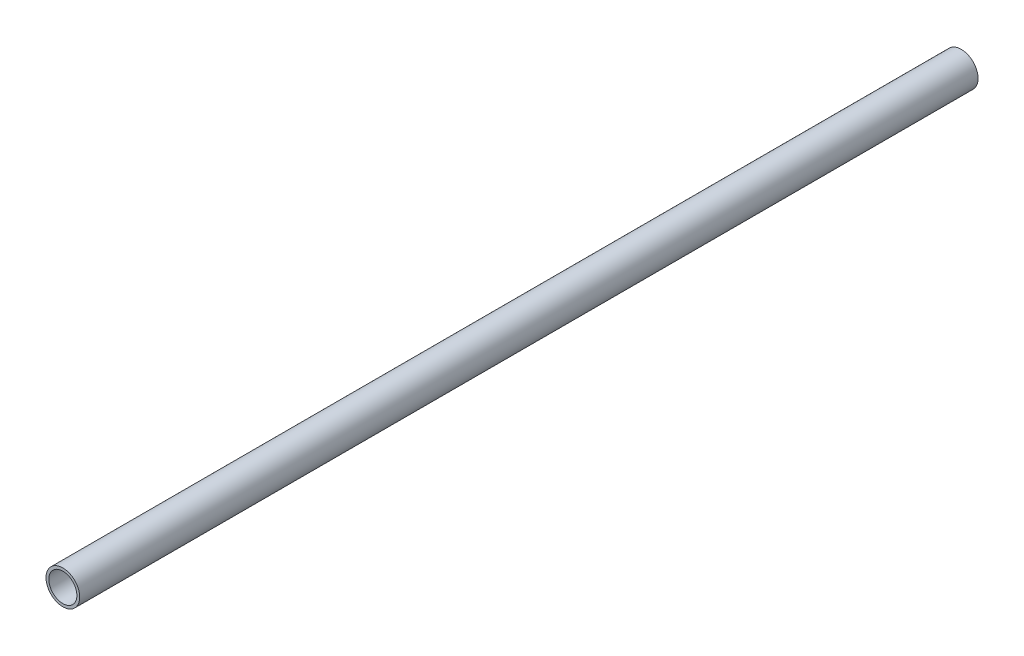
ISO-10303-21;
HEADER;
FILE_DESCRIPTION(('STEP AP214'),'2;1');
FILE_NAME('part.step','',(''),(''),'','','');
FILE_SCHEMA(('AUTOMOTIVE_DESIGN { 1 0 10303 214 1 1 1 1 }'));
ENDSEC;
DATA;
#1=APPLICATION_CONTEXT('core data for automotive mechanical design processes');
#2=APPLICATION_PROTOCOL_DEFINITION('international standard','automotive_design',2000,#1);
#3=PRODUCT_CONTEXT('',#1,'mechanical');
#4=PRODUCT('Part','Part','',(#3));
#5=PRODUCT_RELATED_PRODUCT_CATEGORY('part','',(#4));
#6=PRODUCT_DEFINITION_FORMATION('','',#4);
#7=PRODUCT_DEFINITION_CONTEXT('part definition',#1,'design');
#8=PRODUCT_DEFINITION('design','',#6,#7);
#9=PRODUCT_DEFINITION_SHAPE('','',#8);
#10=(LENGTH_UNIT() NAMED_UNIT(*) SI_UNIT(.MILLI.,.METRE.));
#11=(NAMED_UNIT(*) PLANE_ANGLE_UNIT() SI_UNIT($,.RADIAN.));
#12=(NAMED_UNIT(*) SI_UNIT($,.STERADIAN.) SOLID_ANGLE_UNIT());
#13=UNCERTAINTY_MEASURE_WITH_UNIT(LENGTH_MEASURE(1.E-05),#10,'distance_accuracy_value','');
#14=(GEOMETRIC_REPRESENTATION_CONTEXT(3) GLOBAL_UNCERTAINTY_ASSIGNED_CONTEXT((#13)) GLOBAL_UNIT_ASSIGNED_CONTEXT((#10,
#11,#12)) REPRESENTATION_CONTEXT('',''));
#15=CARTESIAN_POINT('',(0.,0.,0.));
#16=DIRECTION('',(0.,0.,1.));
#17=DIRECTION('',(1.,0.,0.));
#18=AXIS2_PLACEMENT_3D('',#15,#16,#17);
#19=CARTESIAN_POINT('',(0.,0.,320.));
#20=DIRECTION('',(0.,0.,-1.));
#21=DIRECTION('',(-1.,0.,0.));
#22=AXIS2_PLACEMENT_3D('',#19,#20,#21);
#23=CYLINDRICAL_SURFACE('',#22,5.);
#24=CARTESIAN_POINT('',(0.,0.,0.));
#25=DIRECTION('',(0.,0.,-1.));
#26=DIRECTION('',(-1.,0.,0.));
#27=AXIS2_PLACEMENT_3D('',#24,#25,#26);
#28=CIRCLE('',#27,5.);
#29=CARTESIAN_POINT('',(-5.,0.,0.));
#30=VERTEX_POINT('',#29);
#31=EDGE_CURVE('E27',#30,#30,#28,.T.);
#32=ORIENTED_EDGE('',*,*,#31,.T.);
#33=EDGE_LOOP('',(#32));
#34=FACE_BOUND('',#33,.T.);
#35=CARTESIAN_POINT('',(0.,0.,320.));
#36=DIRECTION('',(0.,0.,-1.));
#37=DIRECTION('',(-1.,0.,0.));
#38=AXIS2_PLACEMENT_3D('',#35,#36,#37);
#39=CIRCLE('',#38,5.);
#40=CARTESIAN_POINT('',(-5.,0.,320.));
#41=VERTEX_POINT('',#40);
#42=EDGE_CURVE('E18',#41,#41,#39,.T.);
#43=ORIENTED_EDGE('',*,*,#42,.F.);
#44=EDGE_LOOP('',(#43));
#45=FACE_BOUND('',#44,.T.);
#46=ADVANCED_FACE('F15',(#34,#45),#23,.F.);
#47=CARTESIAN_POINT('',(0.,0.,320.));
#48=DIRECTION('',(0.,0.,1.));
#49=DIRECTION('',(1.,0.,0.));
#50=AXIS2_PLACEMENT_3D('',#47,#48,#49);
#51=PLANE('',#50);
#52=ORIENTED_EDGE('',*,*,#42,.T.);
#53=EDGE_LOOP('',(#52));
#54=FACE_BOUND('',#53,.T.);
#55=CARTESIAN_POINT('',(0.,0.,320.));
#56=DIRECTION('',(0.,0.,-1.));
#57=DIRECTION('',(-1.,0.,0.));
#58=AXIS2_PLACEMENT_3D('',#55,#56,#57);
#59=CIRCLE('',#58,6.);
#60=CARTESIAN_POINT('',(-6.,0.,320.));
#61=VERTEX_POINT('',#60);
#62=EDGE_CURVE('E22',#61,#61,#59,.T.);
#63=ORIENTED_EDGE('',*,*,#62,.F.);
#64=EDGE_LOOP('',(#63));
#65=FACE_BOUND('',#64,.T.);
#66=ADVANCED_FACE('F35',(#54,#65),#51,.T.);
#67=CARTESIAN_POINT('',(0.,0.,0.));
#68=DIRECTION('',(0.,0.,1.));
#69=DIRECTION('',(1.,0.,0.));
#70=AXIS2_PLACEMENT_3D('',#67,#68,#69);
#71=PLANE('',#70);
#72=ORIENTED_EDGE('',*,*,#31,.F.);
#73=EDGE_LOOP('',(#72));
#74=FACE_BOUND('',#73,.T.);
#75=CARTESIAN_POINT('',(0.,0.,0.));
#76=DIRECTION('',(0.,0.,-1.));
#77=DIRECTION('',(-1.,0.,0.));
#78=AXIS2_PLACEMENT_3D('',#75,#76,#77);
#79=CIRCLE('',#78,6.);
#80=CARTESIAN_POINT('',(-6.,0.,0.));
#81=VERTEX_POINT('',#80);
#82=EDGE_CURVE('E10',#81,#81,#79,.F.);
#83=ORIENTED_EDGE('',*,*,#82,.F.);
#84=EDGE_LOOP('',(#83));
#85=FACE_BOUND('',#84,.T.);
#86=ADVANCED_FACE('F43',(#74,#85),#71,.F.);
#87=CARTESIAN_POINT('',(0.,0.,320.));
#88=DIRECTION('',(0.,0.,-1.));
#89=DIRECTION('',(-1.,0.,0.));
#90=AXIS2_PLACEMENT_3D('',#87,#88,#89);
#91=CYLINDRICAL_SURFACE('',#90,6.);
#92=ORIENTED_EDGE('',*,*,#82,.T.);
#93=EDGE_LOOP('',(#92));
#94=FACE_BOUND('',#93,.T.);
#95=ORIENTED_EDGE('',*,*,#62,.T.);
#96=EDGE_LOOP('',(#95));
#97=FACE_BOUND('',#96,.T.);
#98=ADVANCED_FACE('F44',(#94,#97),#91,.T.);
#99=CLOSED_SHELL('',(#46,#66,#86,#98));
#100=MANIFOLD_SOLID_BREP('B1',#99);
#101=ADVANCED_BREP_SHAPE_REPRESENTATION('',(#18,#100),#14);
#102=SHAPE_DEFINITION_REPRESENTATION(#9,#101);
ENDSEC;
END-ISO-10303-21;
